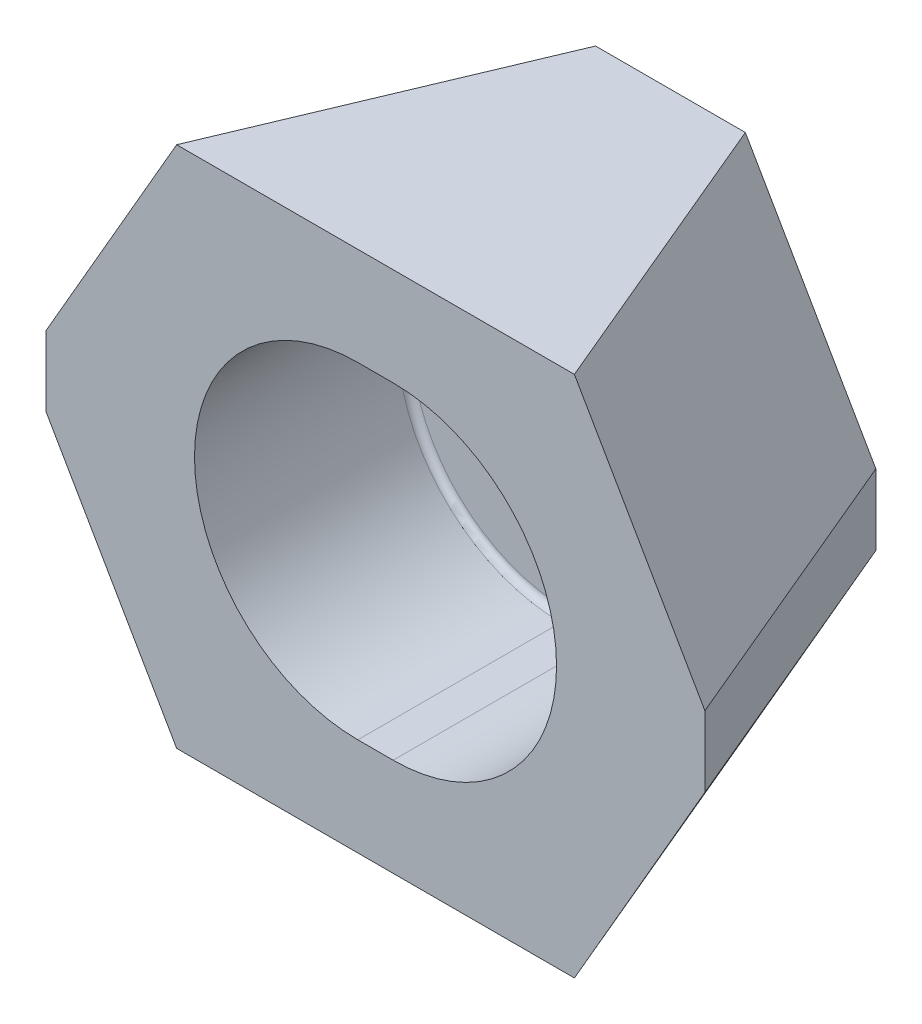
ISO-10303-21;
HEADER;
FILE_DESCRIPTION(('STEP AP214'),'2;1');
FILE_NAME('part.step','',(''),(''),'','','');
FILE_SCHEMA(('AUTOMOTIVE_DESIGN { 1 0 10303 214 1 1 1 1 }'));
ENDSEC;
DATA;
#1=APPLICATION_CONTEXT('core data for automotive mechanical design processes');
#2=APPLICATION_PROTOCOL_DEFINITION('international standard','automotive_design',2000,#1);
#3=PRODUCT_CONTEXT('',#1,'mechanical');
#4=PRODUCT('Part','Part','',(#3));
#5=PRODUCT_RELATED_PRODUCT_CATEGORY('part','',(#4));
#6=PRODUCT_DEFINITION_FORMATION('','',#4);
#7=PRODUCT_DEFINITION_CONTEXT('part definition',#1,'design');
#8=PRODUCT_DEFINITION('design','',#6,#7);
#9=PRODUCT_DEFINITION_SHAPE('','',#8);
#10=(LENGTH_UNIT() NAMED_UNIT(*) SI_UNIT(.MILLI.,.METRE.));
#11=(NAMED_UNIT(*) PLANE_ANGLE_UNIT() SI_UNIT($,.RADIAN.));
#12=(NAMED_UNIT(*) SI_UNIT($,.STERADIAN.) SOLID_ANGLE_UNIT());
#13=UNCERTAINTY_MEASURE_WITH_UNIT(LENGTH_MEASURE(1.E-05),#10,'distance_accuracy_value','');
#14=(GEOMETRIC_REPRESENTATION_CONTEXT(3) GLOBAL_UNCERTAINTY_ASSIGNED_CONTEXT((#13)) GLOBAL_UNIT_ASSIGNED_CONTEXT((#10,
#11,#12)) REPRESENTATION_CONTEXT('',''));
#15=CARTESIAN_POINT('',(0.,0.,0.));
#16=DIRECTION('',(0.,0.,1.));
#17=DIRECTION('',(1.,0.,0.));
#18=AXIS2_PLACEMENT_3D('',#15,#16,#17);
#19=CARTESIAN_POINT('',(1.,0.,16.7));
#20=DIRECTION('',(0.,0.,-1.));
#21=DIRECTION('',(-1.,0.,0.));
#22=AXIS2_PLACEMENT_3D('',#19,#20,#21);
#23=CYLINDRICAL_SURFACE('',#22,6.15);
#24=DIRECTION('',(0.,0.,1.));
#25=VECTOR('',#24,1.);
#26=CARTESIAN_POINT('',(1.,6.15,16.7));
#27=LINE('',#26,#25);
#28=CARTESIAN_POINT('',(1.,6.15,4.8));
#29=VERTEX_POINT('',#28);
#30=CARTESIAN_POINT('',(1.,6.15,0.));
#31=VERTEX_POINT('',#30);
#32=EDGE_CURVE('E122',#29,#31,#27,.F.);
#33=ORIENTED_EDGE('',*,*,#32,.T.);
#34=CARTESIAN_POINT('',(1.,0.,0.));
#35=DIRECTION('',(0.,0.,-1.));
#36=DIRECTION('',(-1.,0.,0.));
#37=AXIS2_PLACEMENT_3D('',#34,#35,#36);
#38=CIRCLE('',#37,6.15);
#39=CARTESIAN_POINT('',(1.,-6.15,0.));
#40=VERTEX_POINT('',#39);
#41=EDGE_CURVE('E136',#31,#40,#38,.T.);
#42=ORIENTED_EDGE('',*,*,#41,.T.);
#43=DIRECTION('',(0.,0.,-1.));
#44=VECTOR('',#43,1.);
#45=CARTESIAN_POINT('',(1.,-6.15,16.7));
#46=LINE('',#45,#44);
#47=CARTESIAN_POINT('',(1.,-6.15,4.8));
#48=VERTEX_POINT('',#47);
#49=EDGE_CURVE('E150',#40,#48,#46,.F.);
#50=ORIENTED_EDGE('',*,*,#49,.T.);
#51=CARTESIAN_POINT('',(1.,0.,4.8));
#52=DIRECTION('',(0.,0.,-1.));
#53=DIRECTION('',(-1.,0.,0.));
#54=AXIS2_PLACEMENT_3D('',#51,#52,#53);
#55=CIRCLE('',#54,6.15);
#56=EDGE_CURVE('E130',#29,#48,#55,.T.);
#57=ORIENTED_EDGE('',*,*,#56,.F.);
#58=EDGE_LOOP('',(#33,#42,#50,#57));
#59=FACE_BOUND('',#58,.T.);
#60=ADVANCED_FACE('F14',(#59),#23,.F.);
#61=CARTESIAN_POINT('',(-1.,-6.15,16.7));
#62=DIRECTION('',(0.,-1.,0.));
#63=DIRECTION('',(0.,0.,-1.));
#64=AXIS2_PLACEMENT_3D('',#61,#62,#63);
#65=PLANE('',#64);
#66=ORIENTED_EDGE('',*,*,#49,.F.);
#67=DIRECTION('',(1.,0.,0.));
#68=VECTOR('',#67,1.);
#69=CARTESIAN_POINT('',(0.,-6.15,0.));
#70=LINE('',#69,#68);
#71=CARTESIAN_POINT('',(-1.,-6.15,0.));
#72=VERTEX_POINT('',#71);
#73=EDGE_CURVE('E138',#40,#72,#70,.F.);
#74=ORIENTED_EDGE('',*,*,#73,.T.);
#75=DIRECTION('',(0.,0.,-1.));
#76=VECTOR('',#75,1.);
#77=CARTESIAN_POINT('',(-1.,-6.15,16.7));
#78=LINE('',#77,#76);
#79=CARTESIAN_POINT('',(-1.,-6.15,4.8));
#80=VERTEX_POINT('',#79);
#81=EDGE_CURVE('E107',#72,#80,#78,.F.);
#82=ORIENTED_EDGE('',*,*,#81,.T.);
#83=DIRECTION('',(1.,0.,0.));
#84=VECTOR('',#83,1.);
#85=CARTESIAN_POINT('',(0.,-6.15,4.8));
#86=LINE('',#85,#84);
#87=EDGE_CURVE('E134',#48,#80,#86,.F.);
#88=ORIENTED_EDGE('',*,*,#87,.F.);
#89=EDGE_LOOP('',(#66,#74,#82,#88));
#90=FACE_BOUND('',#89,.T.);
#91=ADVANCED_FACE('F549',(#90),#65,.F.);
#92=CARTESIAN_POINT('',(-1.,0.,16.7));
#93=DIRECTION('',(0.,0.,-1.));
#94=DIRECTION('',(-1.,0.,0.));
#95=AXIS2_PLACEMENT_3D('',#92,#93,#94);
#96=CYLINDRICAL_SURFACE('',#95,6.15);
#97=ORIENTED_EDGE('',*,*,#81,.F.);
#98=CARTESIAN_POINT('',(-1.,0.,0.));
#99=DIRECTION('',(0.,0.,-1.));
#100=DIRECTION('',(-1.,0.,0.));
#101=AXIS2_PLACEMENT_3D('',#98,#99,#100);
#102=CIRCLE('',#101,6.15);
#103=CARTESIAN_POINT('',(-1.,6.15,0.));
#104=VERTEX_POINT('',#103);
#105=EDGE_CURVE('E118',#72,#104,#102,.T.);
#106=ORIENTED_EDGE('',*,*,#105,.T.);
#107=DIRECTION('',(0.,0.,1.));
#108=VECTOR('',#107,1.);
#109=CARTESIAN_POINT('',(-1.,6.15,16.7));
#110=LINE('',#109,#108);
#111=CARTESIAN_POINT('',(-1.,6.15,4.8));
#112=VERTEX_POINT('',#111);
#113=EDGE_CURVE('E112',#104,#112,#110,.T.);
#114=ORIENTED_EDGE('',*,*,#113,.T.);
#115=CARTESIAN_POINT('',(-1.,0.,4.8));
#116=DIRECTION('',(0.,0.,-1.));
#117=DIRECTION('',(-1.,0.,0.));
#118=AXIS2_PLACEMENT_3D('',#115,#116,#117);
#119=CIRCLE('',#118,6.15);
#120=EDGE_CURVE('E18',#80,#112,#119,.T.);
#121=ORIENTED_EDGE('',*,*,#120,.F.);
#122=EDGE_LOOP('',(#97,#106,#114,#121));
#123=FACE_BOUND('',#122,.T.);
#124=ADVANCED_FACE('F114',(#123),#96,.F.);
#125=CARTESIAN_POINT('',(1.,6.15,16.7));
#126=DIRECTION('',(0.,1.,0.));
#127=DIRECTION('',(0.,0.,1.));
#128=AXIS2_PLACEMENT_3D('',#125,#126,#127);
#129=PLANE('',#128);
#130=ORIENTED_EDGE('',*,*,#113,.F.);
#131=DIRECTION('',(1.,0.,0.));
#132=VECTOR('',#131,1.);
#133=CARTESIAN_POINT('',(0.,6.15,0.));
#134=LINE('',#133,#132);
#135=EDGE_CURVE('E192',#104,#31,#134,.T.);
#136=ORIENTED_EDGE('',*,*,#135,.T.);
#137=ORIENTED_EDGE('',*,*,#32,.F.);
#138=DIRECTION('',(1.,0.,0.));
#139=VECTOR('',#138,1.);
#140=CARTESIAN_POINT('',(0.,6.15,4.8));
#141=LINE('',#140,#139);
#142=EDGE_CURVE('E125',#112,#29,#141,.T.);
#143=ORIENTED_EDGE('',*,*,#142,.F.);
#144=EDGE_LOOP('',(#130,#136,#137,#143));
#145=FACE_BOUND('',#144,.T.);
#146=ADVANCED_FACE('F126',(#145),#129,.F.);
#147=CARTESIAN_POINT('',(0.,0.,4.8));
#148=DIRECTION('',(0.,0.,1.));
#149=DIRECTION('',(1.,0.,0.));
#150=AXIS2_PLACEMENT_3D('',#147,#148,#149);
#151=PLANE('',#150);
#152=ORIENTED_EDGE('',*,*,#56,.T.);
#153=ORIENTED_EDGE('',*,*,#87,.T.);
#154=ORIENTED_EDGE('',*,*,#120,.T.);
#155=ORIENTED_EDGE('',*,*,#142,.T.);
#156=EDGE_LOOP('',(#152,#153,#154,#155));
#157=FACE_BOUND('',#156,.T.);
#158=CARTESIAN_POINT('',(-1.,0.,4.8));
#159=DIRECTION('',(0.,0.,1.));
#160=DIRECTION('',(1.,0.,0.));
#161=AXIS2_PLACEMENT_3D('',#158,#159,#160);
#162=CIRCLE('',#161,8.85);
#163=CARTESIAN_POINT('',(-1.,-8.85,4.8));
#164=VERTEX_POINT('',#163);
#165=CARTESIAN_POINT('',(-1.,8.85,4.8));
#166=VERTEX_POINT('',#165);
#167=EDGE_CURVE('E185',#164,#166,#162,.F.);
#168=ORIENTED_EDGE('',*,*,#167,.F.);
#169=DIRECTION('',(1.,0.,0.));
#170=VECTOR('',#169,1.);
#171=CARTESIAN_POINT('',(-0.5,-8.85,4.8));
#172=LINE('',#171,#170);
#173=CARTESIAN_POINT('',(1.,-8.85,4.8));
#174=VERTEX_POINT('',#173);
#175=EDGE_CURVE('E144',#164,#174,#172,.T.);
#176=ORIENTED_EDGE('',*,*,#175,.T.);
#177=CARTESIAN_POINT('',(1.,0.,4.8));
#178=DIRECTION('',(0.,0.,1.));
#179=DIRECTION('',(1.,0.,0.));
#180=AXIS2_PLACEMENT_3D('',#177,#178,#179);
#181=CIRCLE('',#180,8.85);
#182=CARTESIAN_POINT('',(1.,8.85,4.8));
#183=VERTEX_POINT('',#182);
#184=EDGE_CURVE('E146',#183,#174,#181,.F.);
#185=ORIENTED_EDGE('',*,*,#184,.F.);
#186=DIRECTION('',(-1.,0.,0.));
#187=VECTOR('',#186,1.);
#188=CARTESIAN_POINT('',(0.5,8.85,4.8));
#189=LINE('',#188,#187);
#190=EDGE_CURVE('E141',#183,#166,#189,.T.);
#191=ORIENTED_EDGE('',*,*,#190,.T.);
#192=EDGE_LOOP('',(#168,#176,#185,#191));
#193=FACE_BOUND('',#192,.T.);
#194=ADVANCED_FACE('F132',(#157,#193),#151,.T.);
#195=CARTESIAN_POINT('',(0.,0.,0.));
#196=DIRECTION('',(0.,0.,1.));
#197=DIRECTION('',(1.,0.,0.));
#198=AXIS2_PLACEMENT_3D('',#195,#196,#197);
#199=PLANE('',#198);
#200=ORIENTED_EDGE('',*,*,#105,.F.);
#201=ORIENTED_EDGE('',*,*,#73,.F.);
#202=ORIENTED_EDGE('',*,*,#41,.F.);
#203=ORIENTED_EDGE('',*,*,#135,.F.);
#204=EDGE_LOOP('',(#200,#201,#202,#203));
#205=FACE_BOUND('',#204,.T.);
#206=DIRECTION('',(0.,1.,0.));
#207=VECTOR('',#206,1.);
#208=CARTESIAN_POINT('',(11.6299664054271,7.4,0.));
#209=LINE('',#208,#207);
#210=CARTESIAN_POINT('',(11.6299664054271,-2.00244903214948,0.));
#211=VERTEX_POINT('',#210);
#212=CARTESIAN_POINT('',(11.6299664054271,2.0024490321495,0.));
#213=VERTEX_POINT('',#212);
#214=EDGE_CURVE('E205',#211,#213,#209,.T.);
#215=ORIENTED_EDGE('',*,*,#214,.F.);
#216=DIRECTION('',(0.5,0.866025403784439,0.));
#217=VECTOR('',#216,1.);
#218=CARTESIAN_POINT('',(11.4877979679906,-2.24869198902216,0.));
#219=LINE('',#218,#217);
#220=CARTESIAN_POINT('',(4.24129690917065,-14.8,0.));
#221=VERTEX_POINT('',#220);
#222=EDGE_CURVE('E198',#221,#211,#219,.T.);
#223=ORIENTED_EDGE('',*,*,#222,.F.);
#224=DIRECTION('',(1.,0.,0.));
#225=VECTOR('',#224,1.);
#226=CARTESIAN_POINT('',(18.65,-14.8,0.));
#227=LINE('',#226,#225);
#228=CARTESIAN_POINT('',(-4.24129690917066,-14.8,0.));
#229=VERTEX_POINT('',#228);
#230=EDGE_CURVE('E219',#229,#221,#227,.T.);
#231=ORIENTED_EDGE('',*,*,#230,.F.);
#232=DIRECTION('',(0.5,-0.866025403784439,0.));
#233=VECTOR('',#232,1.);
#234=CARTESIAN_POINT('',(-7.792756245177,-8.64869198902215,0.));
#235=LINE('',#234,#233);
#236=CARTESIAN_POINT('',(-11.6299664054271,-2.00244903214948,0.));
#237=VERTEX_POINT('',#236);
#238=EDGE_CURVE('E225',#237,#229,#235,.T.);
#239=ORIENTED_EDGE('',*,*,#238,.F.);
#240=DIRECTION('',(0.,1.,0.));
#241=VECTOR('',#240,1.);
#242=CARTESIAN_POINT('',(-11.6299664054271,-7.4,0.));
#243=LINE('',#242,#241);
#244=CARTESIAN_POINT('',(-11.6299664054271,2.0024490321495,0.));
#245=VERTEX_POINT('',#244);
#246=EDGE_CURVE('E231',#245,#237,#243,.F.);
#247=ORIENTED_EDGE('',*,*,#246,.F.);
#248=DIRECTION('',(-0.5,-0.866025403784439,0.));
#249=VECTOR('',#248,1.);
#250=CARTESIAN_POINT('',(-11.4877979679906,2.24869198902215,0.));
#251=LINE('',#250,#249);
#252=CARTESIAN_POINT('',(-4.24129690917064,14.8,0.));
#253=VERTEX_POINT('',#252);
#254=EDGE_CURVE('E237',#253,#245,#251,.T.);
#255=ORIENTED_EDGE('',*,*,#254,.F.);
#256=DIRECTION('',(1.,0.,0.));
#257=VECTOR('',#256,1.);
#258=CARTESIAN_POINT('',(-18.65,14.8,0.));
#259=LINE('',#258,#257);
#260=CARTESIAN_POINT('',(4.24129690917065,14.8,0.));
#261=VERTEX_POINT('',#260);
#262=EDGE_CURVE('E243',#261,#253,#259,.F.);
#263=ORIENTED_EDGE('',*,*,#262,.F.);
#264=DIRECTION('',(-0.5,0.866025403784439,0.));
#265=VECTOR('',#264,1.);
#266=CARTESIAN_POINT('',(7.792756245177,8.64869198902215,0.));
#267=LINE('',#266,#265);
#268=EDGE_CURVE('E212',#213,#261,#267,.T.);
#269=ORIENTED_EDGE('',*,*,#268,.F.);
#270=EDGE_LOOP('',(#215,#223,#231,#239,#247,#255,#263,#269));
#271=FACE_BOUND('',#270,.T.);
#272=ADVANCED_FACE('F357',(#205,#271),#199,.F.);
#273=CARTESIAN_POINT('',(1.,0.,5.2));
#274=DIRECTION('',(0.,0.,1.));
#275=DIRECTION('',(1.,0.,0.));
#276=AXIS2_PLACEMENT_3D('',#273,#274,#275);
#277=TOROIDAL_SURFACE('',#276,8.85,0.4);
#278=CARTESIAN_POINT('',(1.,8.85,5.2));
#279=DIRECTION('',(-1.,0.,0.));
#280=DIRECTION('',(0.,-1.,0.));
#281=AXIS2_PLACEMENT_3D('',#278,#279,#280);
#282=CIRCLE('',#281,0.4);
#283=CARTESIAN_POINT('',(1.,9.25,5.2));
#284=VERTEX_POINT('',#283);
#285=EDGE_CURVE('E188',#284,#183,#282,.T.);
#286=ORIENTED_EDGE('',*,*,#285,.T.);
#287=ORIENTED_EDGE('',*,*,#184,.T.);
#288=CARTESIAN_POINT('',(1.,-8.85,5.2));
#289=DIRECTION('',(1.,0.,0.));
#290=DIRECTION('',(0.,1.,0.));
#291=AXIS2_PLACEMENT_3D('',#288,#289,#290);
#292=CIRCLE('',#291,0.4);
#293=CARTESIAN_POINT('',(1.,-9.25,5.2));
#294=VERTEX_POINT('',#293);
#295=EDGE_CURVE('E145',#174,#294,#292,.F.);
#296=ORIENTED_EDGE('',*,*,#295,.T.);
#297=CARTESIAN_POINT('',(1.,0.,5.2));
#298=DIRECTION('',(0.,0.,-1.));
#299=DIRECTION('',(-1.,0.,0.));
#300=AXIS2_PLACEMENT_3D('',#297,#298,#299);
#301=CIRCLE('',#300,9.25);
#302=EDGE_CURVE('E208',#294,#284,#301,.F.);
#303=ORIENTED_EDGE('',*,*,#302,.T.);
#304=EDGE_LOOP('',(#286,#287,#296,#303));
#305=FACE_BOUND('',#304,.T.);
#306=ADVANCED_FACE('F298',(#305),#277,.F.);
#307=CARTESIAN_POINT('',(-0.5,-8.85,5.2));
#308=DIRECTION('',(1.,0.,0.));
#309=DIRECTION('',(0.,1.,0.));
#310=AXIS2_PLACEMENT_3D('',#307,#308,#309);
#311=CYLINDRICAL_SURFACE('',#310,0.4);
#312=DIRECTION('',(1.,0.,0.));
#313=VECTOR('',#312,1.);
#314=CARTESIAN_POINT('',(-1.,-9.25,5.2));
#315=LINE('',#314,#313);
#316=CARTESIAN_POINT('',(-1.,-9.25,5.2));
#317=VERTEX_POINT('',#316);
#318=EDGE_CURVE('E288',#317,#294,#315,.T.);
#319=ORIENTED_EDGE('',*,*,#318,.T.);
#320=ORIENTED_EDGE('',*,*,#295,.F.);
#321=ORIENTED_EDGE('',*,*,#175,.F.);
#322=CARTESIAN_POINT('',(-1.,-8.85,5.2));
#323=DIRECTION('',(1.,0.,0.));
#324=DIRECTION('',(0.,1.,0.));
#325=AXIS2_PLACEMENT_3D('',#322,#323,#324);
#326=CIRCLE('',#325,0.4);
#327=EDGE_CURVE('E189',#317,#164,#326,.T.);
#328=ORIENTED_EDGE('',*,*,#327,.F.);
#329=EDGE_LOOP('',(#319,#320,#321,#328));
#330=FACE_BOUND('',#329,.T.);
#331=ADVANCED_FACE('F311',(#330),#311,.F.);
#332=CARTESIAN_POINT('',(-1.,0.,5.2));
#333=DIRECTION('',(0.,0.,1.));
#334=DIRECTION('',(1.,0.,0.));
#335=AXIS2_PLACEMENT_3D('',#332,#333,#334);
#336=TOROIDAL_SURFACE('',#335,8.85,0.4);
#337=CARTESIAN_POINT('',(-1.,8.85,5.2));
#338=DIRECTION('',(-1.,0.,0.));
#339=DIRECTION('',(0.,-1.,0.));
#340=AXIS2_PLACEMENT_3D('',#337,#338,#339);
#341=CIRCLE('',#340,0.4);
#342=CARTESIAN_POINT('',(-1.,9.25,5.2));
#343=VERTEX_POINT('',#342);
#344=EDGE_CURVE('E216',#166,#343,#341,.F.);
#345=ORIENTED_EDGE('',*,*,#344,.T.);
#346=CARTESIAN_POINT('',(-1.,0.,5.2));
#347=DIRECTION('',(0.,0.,-1.));
#348=DIRECTION('',(-1.,0.,0.));
#349=AXIS2_PLACEMENT_3D('',#346,#347,#348);
#350=CIRCLE('',#349,9.25);
#351=EDGE_CURVE('E274',#343,#317,#350,.F.);
#352=ORIENTED_EDGE('',*,*,#351,.T.);
#353=ORIENTED_EDGE('',*,*,#327,.T.);
#354=ORIENTED_EDGE('',*,*,#167,.T.);
#355=EDGE_LOOP('',(#345,#352,#353,#354));
#356=FACE_BOUND('',#355,.T.);
#357=ADVANCED_FACE('F16',(#356),#336,.F.);
#358=CARTESIAN_POINT('',(0.5,8.85,5.2));
#359=DIRECTION('',(-1.,0.,0.));
#360=DIRECTION('',(0.,-1.,0.));
#361=AXIS2_PLACEMENT_3D('',#358,#359,#360);
#362=CYLINDRICAL_SURFACE('',#361,0.4);
#363=ORIENTED_EDGE('',*,*,#190,.F.);
#364=ORIENTED_EDGE('',*,*,#285,.F.);
#365=DIRECTION('',(1.,0.,0.));
#366=VECTOR('',#365,1.);
#367=CARTESIAN_POINT('',(1.,9.25,5.2));
#368=LINE('',#367,#366);
#369=EDGE_CURVE('E184',#284,#343,#368,.F.);
#370=ORIENTED_EDGE('',*,*,#369,.T.);
#371=ORIENTED_EDGE('',*,*,#344,.F.);
#372=EDGE_LOOP('',(#363,#364,#370,#371));
#373=FACE_BOUND('',#372,.T.);
#374=ADVANCED_FACE('F379',(#373),#362,.F.);
#375=CARTESIAN_POINT('',(10.4247386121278,10.1682677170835,8.35));
#376=DIRECTION('',(0.813797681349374,0.469846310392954,-0.342020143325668));
#377=DIRECTION('',(-0.5,0.866025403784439,0.));
#378=AXIS2_PLACEMENT_3D('',#375,#376,#377);
#379=PLANE('',#378);
#380=DIRECTION('',(-0.387449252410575,0.,-0.921891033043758));
#381=VECTOR('',#380,1.);
#382=CARTESIAN_POINT('',(11.2599165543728,14.8,16.7));
#383=LINE('',#382,#381);
#384=CARTESIAN_POINT('',(11.2599165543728,14.8,16.7));
#385=VERTEX_POINT('',#384);
#386=EDGE_CURVE('E215',#385,#261,#383,.T.);
#387=ORIENTED_EDGE('',*,*,#386,.F.);
#388=DIRECTION('',(-0.5,0.866025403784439,0.));
#389=VECTOR('',#388,1.);
#390=CARTESIAN_POINT('',(18.65,2.,16.7));
#391=LINE('',#390,#389);
#392=CARTESIAN_POINT('',(18.65,2.,16.7));
#393=VERTEX_POINT('',#392);
#394=EDGE_CURVE('E181',#393,#385,#391,.T.);
#395=ORIENTED_EDGE('',*,*,#394,.F.);
#396=DIRECTION('',(0.387515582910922,-0.0001351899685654,0.921863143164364));
#397=VECTOR('',#396,1.);
#398=CARTESIAN_POINT('',(11.6299664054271,2.0024490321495,0.));
#399=LINE('',#398,#397);
#400=EDGE_CURVE('E201',#213,#393,#399,.T.);
#401=ORIENTED_EDGE('',*,*,#400,.F.);
#402=ORIENTED_EDGE('',*,*,#268,.T.);
#403=EDGE_LOOP('',(#387,#395,#401,#402));
#404=FACE_BOUND('',#403,.T.);
#405=ADVANCED_FACE('F370',(#404),#379,.T.);
#406=CARTESIAN_POINT('',(-18.65,14.8,0.));
#407=DIRECTION('',(0.,1.,0.));
#408=DIRECTION('',(0.,0.,1.));
#409=AXIS2_PLACEMENT_3D('',#406,#407,#408);
#410=PLANE('',#409);
#411=DIRECTION('',(0.387449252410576,0.,-0.921891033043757));
#412=VECTOR('',#411,1.);
#413=CARTESIAN_POINT('',(-11.2599165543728,14.8,16.7));
#414=LINE('',#413,#412);
#415=CARTESIAN_POINT('',(-11.2599165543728,14.8,16.7));
#416=VERTEX_POINT('',#415);
#417=EDGE_CURVE('E240',#416,#253,#414,.T.);
#418=ORIENTED_EDGE('',*,*,#417,.F.);
#419=DIRECTION('',(1.,0.,0.));
#420=VECTOR('',#419,1.);
#421=CARTESIAN_POINT('',(0.,14.8,16.7));
#422=LINE('',#421,#420);
#423=EDGE_CURVE('E178',#385,#416,#422,.F.);
#424=ORIENTED_EDGE('',*,*,#423,.F.);
#425=ORIENTED_EDGE('',*,*,#386,.T.);
#426=ORIENTED_EDGE('',*,*,#262,.T.);
#427=EDGE_LOOP('',(#418,#424,#425,#426));
#428=FACE_BOUND('',#427,.T.);
#429=ADVANCED_FACE('F368',(#428),#410,.T.);
#430=CARTESIAN_POINT('',(-14.1197803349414,3.76826771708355,8.35));
#431=DIRECTION('',(-0.813797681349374,0.469846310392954,-0.342020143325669));
#432=DIRECTION('',(-0.5,-0.866025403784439,0.));
#433=AXIS2_PLACEMENT_3D('',#430,#431,#432);
#434=PLANE('',#433);
#435=DIRECTION('',(0.387515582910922,0.000135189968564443,-0.921863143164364));
#436=VECTOR('',#435,1.);
#437=CARTESIAN_POINT('',(-18.65,2.,16.7));
#438=LINE('',#437,#436);
#439=CARTESIAN_POINT('',(-18.65,2.,16.7));
#440=VERTEX_POINT('',#439);
#441=EDGE_CURVE('E234',#440,#245,#438,.T.);
#442=ORIENTED_EDGE('',*,*,#441,.F.);
#443=DIRECTION('',(-0.5,-0.866025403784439,0.));
#444=VECTOR('',#443,1.);
#445=CARTESIAN_POINT('',(-11.2599165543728,14.8,16.7));
#446=LINE('',#445,#444);
#447=EDGE_CURVE('E175',#416,#440,#446,.T.);
#448=ORIENTED_EDGE('',*,*,#447,.F.);
#449=ORIENTED_EDGE('',*,*,#417,.T.);
#450=ORIENTED_EDGE('',*,*,#254,.T.);
#451=EDGE_LOOP('',(#442,#448,#449,#450));
#452=FACE_BOUND('',#451,.T.);
#453=ADVANCED_FACE('F354',(#452),#434,.T.);
#454=CARTESIAN_POINT('',(-15.1399832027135,-7.4,8.35));
#455=DIRECTION('',(-0.921863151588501,0.,-0.387515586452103));
#456=DIRECTION('',(-0.387515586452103,0.,0.921863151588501));
#457=AXIS2_PLACEMENT_3D('',#454,#455,#456);
#458=PLANE('',#457);
#459=ORIENTED_EDGE('',*,*,#441,.T.);
#460=ORIENTED_EDGE('',*,*,#246,.T.);
#461=DIRECTION('',(0.387515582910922,-0.000135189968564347,-0.921863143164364));
#462=VECTOR('',#461,1.);
#463=CARTESIAN_POINT('',(-18.65,-2.,16.7));
#464=LINE('',#463,#462);
#465=CARTESIAN_POINT('',(-18.65,-2.,16.7));
#466=VERTEX_POINT('',#465);
#467=EDGE_CURVE('E228',#466,#237,#464,.T.);
#468=ORIENTED_EDGE('',*,*,#467,.F.);
#469=DIRECTION('',(0.,1.,0.));
#470=VECTOR('',#469,1.);
#471=CARTESIAN_POINT('',(-18.65,0.,16.7));
#472=LINE('',#471,#470);
#473=EDGE_CURVE('E172',#440,#466,#472,.F.);
#474=ORIENTED_EDGE('',*,*,#473,.F.);
#475=EDGE_LOOP('',(#459,#460,#468,#474));
#476=FACE_BOUND('',#475,.T.);
#477=ADVANCED_FACE('F347',(#476),#458,.T.);
#478=CARTESIAN_POINT('',(-10.4247386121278,-10.1682677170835,8.35));
#479=DIRECTION('',(-0.813797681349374,-0.469846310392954,-0.342020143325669));
#480=DIRECTION('',(0.5,-0.866025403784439,0.));
#481=AXIS2_PLACEMENT_3D('',#478,#479,#480);
#482=PLANE('',#481);
#483=DIRECTION('',(0.387449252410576,0.,-0.921891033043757));
#484=VECTOR('',#483,1.);
#485=CARTESIAN_POINT('',(-11.2599165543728,-14.8,16.7));
#486=LINE('',#485,#484);
#487=CARTESIAN_POINT('',(-11.2599165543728,-14.8,16.7));
#488=VERTEX_POINT('',#487);
#489=EDGE_CURVE('E222',#488,#229,#486,.T.);
#490=ORIENTED_EDGE('',*,*,#489,.F.);
#491=DIRECTION('',(0.5,-0.866025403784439,0.));
#492=VECTOR('',#491,1.);
#493=CARTESIAN_POINT('',(-18.65,-2.,16.7));
#494=LINE('',#493,#492);
#495=EDGE_CURVE('E169',#466,#488,#494,.T.);
#496=ORIENTED_EDGE('',*,*,#495,.F.);
#497=ORIENTED_EDGE('',*,*,#467,.T.);
#498=ORIENTED_EDGE('',*,*,#238,.T.);
#499=EDGE_LOOP('',(#490,#496,#497,#498));
#500=FACE_BOUND('',#499,.T.);
#501=ADVANCED_FACE('F364',(#500),#482,.T.);
#502=CARTESIAN_POINT('',(18.65,-14.8,0.));
#503=DIRECTION('',(0.,-1.,0.));
#504=DIRECTION('',(0.,0.,-1.));
#505=AXIS2_PLACEMENT_3D('',#502,#503,#504);
#506=PLANE('',#505);
#507=ORIENTED_EDGE('',*,*,#489,.T.);
#508=ORIENTED_EDGE('',*,*,#230,.T.);
#509=DIRECTION('',(-0.387449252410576,0.,-0.921891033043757));
#510=VECTOR('',#509,1.);
#511=CARTESIAN_POINT('',(11.2599165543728,-14.8,16.7));
#512=LINE('',#511,#510);
#513=CARTESIAN_POINT('',(11.2599165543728,-14.8,16.7));
#514=VERTEX_POINT('',#513);
#515=EDGE_CURVE('E202',#514,#221,#512,.T.);
#516=ORIENTED_EDGE('',*,*,#515,.F.);
#517=DIRECTION('',(1.,0.,0.));
#518=VECTOR('',#517,1.);
#519=CARTESIAN_POINT('',(0.,-14.8,16.7));
#520=LINE('',#519,#518);
#521=EDGE_CURVE('E166',#488,#514,#520,.T.);
#522=ORIENTED_EDGE('',*,*,#521,.F.);
#523=EDGE_LOOP('',(#507,#508,#516,#522));
#524=FACE_BOUND('',#523,.T.);
#525=ADVANCED_FACE('F407',(#524),#506,.T.);
#526=CARTESIAN_POINT('',(14.1197803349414,-3.76826771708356,8.35));
#527=DIRECTION('',(0.813797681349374,-0.469846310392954,-0.342020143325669));
#528=DIRECTION('',(0.5,0.866025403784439,0.));
#529=AXIS2_PLACEMENT_3D('',#526,#527,#528);
#530=PLANE('',#529);
#531=DIRECTION('',(-0.387515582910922,-0.000135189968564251,-0.921863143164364));
#532=VECTOR('',#531,1.);
#533=CARTESIAN_POINT('',(18.65,-2.,16.7));
#534=LINE('',#533,#532);
#535=CARTESIAN_POINT('',(18.65,-2.,16.7));
#536=VERTEX_POINT('',#535);
#537=EDGE_CURVE('E209',#536,#211,#534,.T.);
#538=ORIENTED_EDGE('',*,*,#537,.F.);
#539=DIRECTION('',(0.5,0.866025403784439,0.));
#540=VECTOR('',#539,1.);
#541=CARTESIAN_POINT('',(11.2599165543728,-14.8,16.7));
#542=LINE('',#541,#540);
#543=EDGE_CURVE('E163',#514,#536,#542,.T.);
#544=ORIENTED_EDGE('',*,*,#543,.F.);
#545=ORIENTED_EDGE('',*,*,#515,.T.);
#546=ORIENTED_EDGE('',*,*,#222,.T.);
#547=EDGE_LOOP('',(#538,#544,#545,#546));
#548=FACE_BOUND('',#547,.T.);
#549=ADVANCED_FACE('F403',(#548),#530,.T.);
#550=CARTESIAN_POINT('',(15.1399832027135,7.4,8.35));
#551=DIRECTION('',(0.921863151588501,0.,-0.387515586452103));
#552=DIRECTION('',(-0.387515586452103,0.,-0.921863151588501));
#553=AXIS2_PLACEMENT_3D('',#550,#551,#552);
#554=PLANE('',#553);
#555=ORIENTED_EDGE('',*,*,#537,.T.);
#556=ORIENTED_EDGE('',*,*,#214,.T.);
#557=ORIENTED_EDGE('',*,*,#400,.T.);
#558=DIRECTION('',(0.,1.,0.));
#559=VECTOR('',#558,1.);
#560=CARTESIAN_POINT('',(18.65,0.,16.7));
#561=LINE('',#560,#559);
#562=EDGE_CURVE('E160',#536,#393,#561,.T.);
#563=ORIENTED_EDGE('',*,*,#562,.F.);
#564=EDGE_LOOP('',(#555,#556,#557,#563));
#565=FACE_BOUND('',#564,.T.);
#566=ADVANCED_FACE('F400',(#565),#554,.T.);
#567=CARTESIAN_POINT('',(1.,0.,16.7));
#568=DIRECTION('',(0.,0.,-1.));
#569=DIRECTION('',(-1.,0.,0.));
#570=AXIS2_PLACEMENT_3D('',#567,#568,#569);
#571=CYLINDRICAL_SURFACE('',#570,9.25);
#572=DIRECTION('',(0.,0.,-1.));
#573=VECTOR('',#572,1.);
#574=CARTESIAN_POINT('',(1.,-9.25,16.7));
#575=LINE('',#574,#573);
#576=CARTESIAN_POINT('',(1.,-9.25,16.7));
#577=VERTEX_POINT('',#576);
#578=EDGE_CURVE('E262',#294,#577,#575,.F.);
#579=ORIENTED_EDGE('',*,*,#578,.T.);
#580=CARTESIAN_POINT('',(1.,0.,16.7));
#581=DIRECTION('',(0.,0.,-1.));
#582=DIRECTION('',(-1.,0.,0.));
#583=AXIS2_PLACEMENT_3D('',#580,#581,#582);
#584=CIRCLE('',#583,9.25);
#585=CARTESIAN_POINT('',(1.,9.25,16.7));
#586=VERTEX_POINT('',#585);
#587=EDGE_CURVE('E157',#586,#577,#584,.T.);
#588=ORIENTED_EDGE('',*,*,#587,.F.);
#589=DIRECTION('',(0.,0.,1.));
#590=VECTOR('',#589,1.);
#591=CARTESIAN_POINT('',(1.,9.25,16.7));
#592=LINE('',#591,#590);
#593=EDGE_CURVE('E271',#586,#284,#592,.F.);
#594=ORIENTED_EDGE('',*,*,#593,.T.);
#595=ORIENTED_EDGE('',*,*,#302,.F.);
#596=EDGE_LOOP('',(#579,#588,#594,#595));
#597=FACE_BOUND('',#596,.T.);
#598=ADVANCED_FACE('F304',(#597),#571,.F.);
#599=CARTESIAN_POINT('',(-1.,-9.25,16.7));
#600=DIRECTION('',(0.,-1.,0.));
#601=DIRECTION('',(0.,0.,-1.));
#602=AXIS2_PLACEMENT_3D('',#599,#600,#601);
#603=PLANE('',#602);
#604=DIRECTION('',(0.,0.,-1.));
#605=VECTOR('',#604,1.);
#606=CARTESIAN_POINT('',(-1.,-9.25,16.7));
#607=LINE('',#606,#605);
#608=CARTESIAN_POINT('',(-1.,-9.25,16.7));
#609=VERTEX_POINT('',#608);
#610=EDGE_CURVE('E277',#317,#609,#607,.F.);
#611=ORIENTED_EDGE('',*,*,#610,.T.);
#612=DIRECTION('',(1.,0.,0.));
#613=VECTOR('',#612,1.);
#614=CARTESIAN_POINT('',(0.,-9.25,16.7));
#615=LINE('',#614,#613);
#616=EDGE_CURVE('E154',#577,#609,#615,.F.);
#617=ORIENTED_EDGE('',*,*,#616,.F.);
#618=ORIENTED_EDGE('',*,*,#578,.F.);
#619=ORIENTED_EDGE('',*,*,#318,.F.);
#620=EDGE_LOOP('',(#611,#617,#618,#619));
#621=FACE_BOUND('',#620,.T.);
#622=ADVANCED_FACE('F313',(#621),#603,.F.);
#623=CARTESIAN_POINT('',(-1.,0.,16.7));
#624=DIRECTION('',(0.,0.,-1.));
#625=DIRECTION('',(-1.,0.,0.));
#626=AXIS2_PLACEMENT_3D('',#623,#624,#625);
#627=CYLINDRICAL_SURFACE('',#626,9.25);
#628=DIRECTION('',(0.,0.,1.));
#629=VECTOR('',#628,1.);
#630=CARTESIAN_POINT('',(-1.,9.25,16.7));
#631=LINE('',#630,#629);
#632=CARTESIAN_POINT('',(-1.,9.25,16.7));
#633=VERTEX_POINT('',#632);
#634=EDGE_CURVE('E33',#343,#633,#631,.T.);
#635=ORIENTED_EDGE('',*,*,#634,.T.);
#636=CARTESIAN_POINT('',(-1.,0.,16.7));
#637=DIRECTION('',(0.,0.,-1.));
#638=DIRECTION('',(-1.,0.,0.));
#639=AXIS2_PLACEMENT_3D('',#636,#637,#638);
#640=CIRCLE('',#639,9.25);
#641=EDGE_CURVE('E24',#609,#633,#640,.T.);
#642=ORIENTED_EDGE('',*,*,#641,.F.);
#643=ORIENTED_EDGE('',*,*,#610,.F.);
#644=ORIENTED_EDGE('',*,*,#351,.F.);
#645=EDGE_LOOP('',(#635,#642,#643,#644));
#646=FACE_BOUND('',#645,.T.);
#647=ADVANCED_FACE('F390',(#646),#627,.F.);
#648=CARTESIAN_POINT('',(1.,9.25,16.7));
#649=DIRECTION('',(0.,1.,0.));
#650=DIRECTION('',(0.,0.,1.));
#651=AXIS2_PLACEMENT_3D('',#648,#649,#650);
#652=PLANE('',#651);
#653=ORIENTED_EDGE('',*,*,#593,.F.);
#654=DIRECTION('',(1.,0.,0.));
#655=VECTOR('',#654,1.);
#656=CARTESIAN_POINT('',(0.,9.25,16.7));
#657=LINE('',#656,#655);
#658=EDGE_CURVE('E9',#633,#586,#657,.T.);
#659=ORIENTED_EDGE('',*,*,#658,.F.);
#660=ORIENTED_EDGE('',*,*,#634,.F.);
#661=ORIENTED_EDGE('',*,*,#369,.F.);
#662=EDGE_LOOP('',(#653,#659,#660,#661));
#663=FACE_BOUND('',#662,.T.);
#664=ADVANCED_FACE('F383',(#663),#652,.F.);
#665=CARTESIAN_POINT('',(0.,0.,16.7));
#666=DIRECTION('',(0.,0.,1.));
#667=DIRECTION('',(1.,0.,0.));
#668=AXIS2_PLACEMENT_3D('',#665,#666,#667);
#669=PLANE('',#668);
#670=ORIENTED_EDGE('',*,*,#641,.T.);
#671=ORIENTED_EDGE('',*,*,#658,.T.);
#672=ORIENTED_EDGE('',*,*,#587,.T.);
#673=ORIENTED_EDGE('',*,*,#616,.T.);
#674=EDGE_LOOP('',(#670,#671,#672,#673));
#675=FACE_BOUND('',#674,.T.);
#676=ORIENTED_EDGE('',*,*,#543,.T.);
#677=ORIENTED_EDGE('',*,*,#562,.T.);
#678=ORIENTED_EDGE('',*,*,#394,.T.);
#679=ORIENTED_EDGE('',*,*,#423,.T.);
#680=ORIENTED_EDGE('',*,*,#447,.T.);
#681=ORIENTED_EDGE('',*,*,#473,.T.);
#682=ORIENTED_EDGE('',*,*,#495,.T.);
#683=ORIENTED_EDGE('',*,*,#521,.T.);
#684=EDGE_LOOP('',(#676,#677,#678,#679,#680,#681,#682,#683));
#685=FACE_BOUND('',#684,.T.);
#686=ADVANCED_FACE('F367',(#675,#685),#669,.T.);
#687=CLOSED_SHELL('',(#60,#91,#124,#146,#194,#272,#306,#331,#357,#374,#405,#429,#453,#477,#501,
#525,#549,#566,#598,#622,#647,#664,#686));
#688=MANIFOLD_SOLID_BREP('B1',#687);
#689=ADVANCED_BREP_SHAPE_REPRESENTATION('',(#18,#688),#14);
#690=SHAPE_DEFINITION_REPRESENTATION(#9,#689);
ENDSEC;
END-ISO-10303-21;
